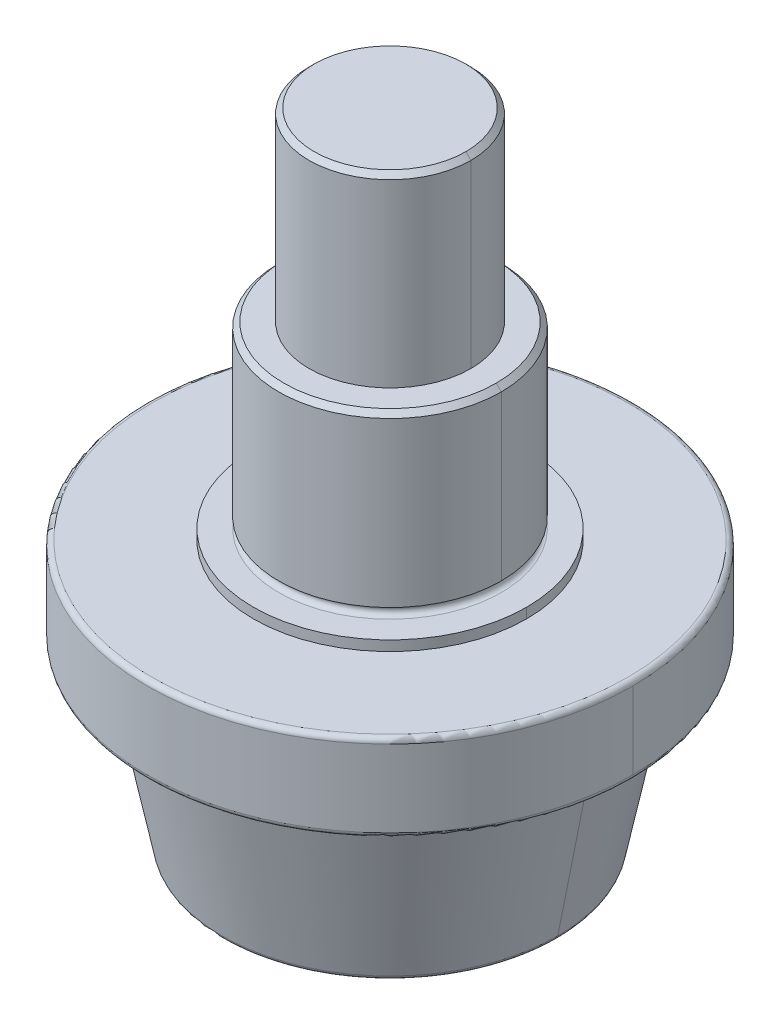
ISO-10303-21;
HEADER;
FILE_DESCRIPTION(('STEP AP214'),'2;1');
FILE_NAME('part.step','',(''),(''),'','','');
FILE_SCHEMA(('AUTOMOTIVE_DESIGN { 1 0 10303 214 1 1 1 1 }'));
ENDSEC;
DATA;
#1=APPLICATION_CONTEXT('core data for automotive mechanical design processes');
#2=APPLICATION_PROTOCOL_DEFINITION('international standard','automotive_design',2000,#1);
#3=PRODUCT_CONTEXT('',#1,'mechanical');
#4=PRODUCT('Part','Part','',(#3));
#5=PRODUCT_RELATED_PRODUCT_CATEGORY('part','',(#4));
#6=PRODUCT_DEFINITION_FORMATION('','',#4);
#7=PRODUCT_DEFINITION_CONTEXT('part definition',#1,'design');
#8=PRODUCT_DEFINITION('design','',#6,#7);
#9=PRODUCT_DEFINITION_SHAPE('','',#8);
#10=(LENGTH_UNIT() NAMED_UNIT(*) SI_UNIT(.MILLI.,.METRE.));
#11=(NAMED_UNIT(*) PLANE_ANGLE_UNIT() SI_UNIT($,.RADIAN.));
#12=(NAMED_UNIT(*) SI_UNIT($,.STERADIAN.) SOLID_ANGLE_UNIT());
#13=UNCERTAINTY_MEASURE_WITH_UNIT(LENGTH_MEASURE(1.E-05),#10,'distance_accuracy_value','');
#14=(GEOMETRIC_REPRESENTATION_CONTEXT(3) GLOBAL_UNCERTAINTY_ASSIGNED_CONTEXT((#13)) GLOBAL_UNIT_ASSIGNED_CONTEXT((#10,
#11,#12)) REPRESENTATION_CONTEXT('',''));
#15=CARTESIAN_POINT('',(0.,0.,0.));
#16=DIRECTION('',(0.,0.,1.));
#17=DIRECTION('',(1.,0.,0.));
#18=AXIS2_PLACEMENT_3D('',#15,#16,#17);
#19=CARTESIAN_POINT('',(-5.95312499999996,50.00625,0.));
#20=DIRECTION('',(0.,1.,0.));
#21=DIRECTION('',(0.,0.,1.));
#22=AXIS2_PLACEMENT_3D('',#19,#20,#21);
#23=PLANE('',#22);
#24=CARTESIAN_POINT('',(0.,50.00625,0.));
#25=DIRECTION('',(0.,-1.,0.));
#26=DIRECTION('',(0.,0.,-1.));
#27=AXIS2_PLACEMENT_3D('',#24,#25,#26);
#28=CIRCLE('',#27,11.90625);
#29=CARTESIAN_POINT('',(11.90625,50.00625,0.));
#30=VERTEX_POINT('',#29);
#31=CARTESIAN_POINT('',(-11.90625,50.00625,0.));
#32=VERTEX_POINT('',#31);
#33=EDGE_CURVE('E19',#30,#32,#28,.T.);
#34=ORIENTED_EDGE('',*,*,#33,.F.);
#35=CARTESIAN_POINT('',(0.,50.00625,0.));
#36=DIRECTION('',(0.,-1.,0.));
#37=DIRECTION('',(0.,0.,-1.));
#38=AXIS2_PLACEMENT_3D('',#35,#36,#37);
#39=CIRCLE('',#38,11.90625);
#40=EDGE_CURVE('E90',#32,#30,#39,.T.);
#41=ORIENTED_EDGE('',*,*,#40,.F.);
#42=EDGE_LOOP('',(#34,#41));
#43=FACE_BOUND('',#42,.T.);
#44=ADVANCED_FACE('F16',(#43),#23,.T.);
#45=CARTESIAN_POINT('',(-12.7718817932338,-50.00625,0.));
#46=DIRECTION('',(0.,-1.,0.));
#47=DIRECTION('',(1.,0.,0.));
#48=AXIS2_PLACEMENT_3D('',#45,#46,#47);
#49=PLANE('',#48);
#50=CARTESIAN_POINT('',(0.,-50.00625,0.));
#51=DIRECTION('',(0.,1.,0.));
#52=DIRECTION('',(-1.,0.,0.));
#53=AXIS2_PLACEMENT_3D('',#50,#51,#52);
#54=CIRCLE('',#53,25.5437635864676);
#55=CARTESIAN_POINT('',(-25.5437635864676,-50.00625,0.));
#56=VERTEX_POINT('',#55);
#57=EDGE_CURVE('E32',#56,#56,#54,.T.);
#58=ORIENTED_EDGE('',*,*,#57,.F.);
#59=EDGE_LOOP('',(#58));
#60=FACE_BOUND('',#59,.T.);
#61=ADVANCED_FACE('F108',(#60),#49,.T.);
#62=CARTESIAN_POINT('',(0.,49.2125,0.));
#63=DIRECTION('',(0.,-1.,0.));
#64=DIRECTION('',(0.,0.,-1.));
#65=AXIS2_PLACEMENT_3D('',#62,#63,#64);
#66=CONICAL_SURFACE('',#65,12.7,0.78539816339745);
#67=DIRECTION('',(-0.707106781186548,0.707106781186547,0.));
#68=VECTOR('',#67,1.);
#69=CARTESIAN_POINT('',(12.303125,49.609375,0.));
#70=LINE('',#69,#68);
#71=CARTESIAN_POINT('',(12.7,49.2125,0.));
#72=VERTEX_POINT('',#71);
#73=EDGE_CURVE('E88',#30,#72,#70,.F.);
#74=ORIENTED_EDGE('',*,*,#73,.F.);
#75=ORIENTED_EDGE('',*,*,#33,.T.);
#76=DIRECTION('',(0.707106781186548,0.707106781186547,0.));
#77=VECTOR('',#76,1.);
#78=CARTESIAN_POINT('',(-12.303125,49.609375,0.));
#79=LINE('',#78,#77);
#80=CARTESIAN_POINT('',(-12.7,49.2125,0.));
#81=VERTEX_POINT('',#80);
#82=EDGE_CURVE('E85',#81,#32,#79,.T.);
#83=ORIENTED_EDGE('',*,*,#82,.F.);
#84=CARTESIAN_POINT('',(0.,49.2125,0.));
#85=DIRECTION('',(0.,1.,0.));
#86=DIRECTION('',(-1.,0.,0.));
#87=AXIS2_PLACEMENT_3D('',#84,#85,#86);
#88=CIRCLE('',#87,12.7);
#89=EDGE_CURVE('E134',#72,#81,#88,.F.);
#90=ORIENTED_EDGE('',*,*,#89,.F.);
#91=EDGE_LOOP('',(#74,#75,#83,#90));
#92=FACE_BOUND('',#91,.T.);
#93=ADVANCED_FACE('F83',(#92),#66,.T.);
#94=CARTESIAN_POINT('',(0.,49.2125,0.));
#95=DIRECTION('',(0.,-1.,0.));
#96=DIRECTION('',(0.,0.,-1.));
#97=AXIS2_PLACEMENT_3D('',#94,#95,#96);
#98=CONICAL_SURFACE('',#97,12.7,0.78539816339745);
#99=ORIENTED_EDGE('',*,*,#73,.T.);
#100=CARTESIAN_POINT('',(0.,49.2125,0.));
#101=DIRECTION('',(0.,1.,0.));
#102=DIRECTION('',(-1.,0.,0.));
#103=AXIS2_PLACEMENT_3D('',#100,#101,#102);
#104=CIRCLE('',#103,12.7);
#105=EDGE_CURVE('E95',#81,#72,#104,.F.);
#106=ORIENTED_EDGE('',*,*,#105,.F.);
#107=ORIENTED_EDGE('',*,*,#82,.T.);
#108=ORIENTED_EDGE('',*,*,#40,.T.);
#109=EDGE_LOOP('',(#99,#106,#107,#108));
#110=FACE_BOUND('',#109,.T.);
#111=ADVANCED_FACE('F93',(#110),#98,.T.);
#112=CARTESIAN_POINT('',(0.,-49.2125,0.));
#113=DIRECTION('',(0.,-1.,0.));
#114=DIRECTION('',(0.,0.,-1.));
#115=AXIS2_PLACEMENT_3D('',#112,#113,#114);
#116=TOROIDAL_SURFACE('',#115,25.5437635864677,0.793750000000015);
#117=CARTESIAN_POINT('',(0.,-49.3690271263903,0.));
#118=DIRECTION('',(0.,1.,0.));
#119=DIRECTION('',(-1.,0.,0.));
#120=AXIS2_PLACEMENT_3D('',#117,#118,#119);
#121=CIRCLE('',#120,26.3219270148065);
#122=CARTESIAN_POINT('',(-26.3219270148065,-49.3690271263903,0.));
#123=VERTEX_POINT('',#122);
#124=CARTESIAN_POINT('',(26.3219270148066,-49.3690271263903,0.));
#125=VERTEX_POINT('',#124);
#126=EDGE_CURVE('E151',#123,#125,#121,.T.);
#127=ORIENTED_EDGE('',*,*,#126,.F.);
#128=CARTESIAN_POINT('',(0.,-49.3690271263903,0.));
#129=DIRECTION('',(0.,1.,0.));
#130=DIRECTION('',(-1.,0.,0.));
#131=AXIS2_PLACEMENT_3D('',#128,#129,#130);
#132=CIRCLE('',#131,26.3219270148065);
#133=EDGE_CURVE('E166',#125,#123,#132,.T.);
#134=ORIENTED_EDGE('',*,*,#133,.F.);
#135=EDGE_LOOP('',(#127,#134));
#136=FACE_BOUND('',#135,.T.);
#137=ORIENTED_EDGE('',*,*,#57,.T.);
#138=EDGE_LOOP('',(#137));
#139=FACE_BOUND('',#138,.T.);
#140=ADVANCED_FACE('F121',(#136,#139),#116,.T.);
#141=CARTESIAN_POINT('',(0.,35.0678750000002,0.));
#142=DIRECTION('',(0.,1.,0.));
#143=DIRECTION('',(-1.,0.,0.));
#144=AXIS2_PLACEMENT_3D('',#141,#142,#143);
#145=CYLINDRICAL_SURFACE('',#144,12.7);
#146=DIRECTION('',(0.,1.,0.));
#147=VECTOR('',#146,1.);
#148=CARTESIAN_POINT('',(12.7,35.0678750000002,0.));
#149=LINE('',#148,#147);
#150=CARTESIAN_POINT('',(12.7,20.9232499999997,0.));
#151=VERTEX_POINT('',#150);
#152=EDGE_CURVE('E140',#72,#151,#149,.F.);
#153=ORIENTED_EDGE('',*,*,#152,.F.);
#154=ORIENTED_EDGE('',*,*,#89,.T.);
#155=DIRECTION('',(0.,1.,0.));
#156=VECTOR('',#155,1.);
#157=CARTESIAN_POINT('',(-12.7,35.0678750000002,0.));
#158=LINE('',#157,#156);
#159=CARTESIAN_POINT('',(-12.7,20.9232499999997,0.));
#160=VERTEX_POINT('',#159);
#161=EDGE_CURVE('E136',#160,#81,#158,.T.);
#162=ORIENTED_EDGE('',*,*,#161,.F.);
#163=CARTESIAN_POINT('',(0.,20.9232499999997,0.));
#164=DIRECTION('',(0.,1.,0.));
#165=DIRECTION('',(-1.,0.,0.));
#166=AXIS2_PLACEMENT_3D('',#163,#164,#165);
#167=CIRCLE('',#166,12.7);
#168=EDGE_CURVE('E147',#151,#160,#167,.F.);
#169=ORIENTED_EDGE('',*,*,#168,.F.);
#170=EDGE_LOOP('',(#153,#154,#162,#169));
#171=FACE_BOUND('',#170,.T.);
#172=ADVANCED_FACE('F126',(#171),#145,.T.);
#173=CARTESIAN_POINT('',(0.,35.0678750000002,0.));
#174=DIRECTION('',(0.,1.,0.));
#175=DIRECTION('',(-1.,0.,0.));
#176=AXIS2_PLACEMENT_3D('',#173,#174,#175);
#177=CYLINDRICAL_SURFACE('',#176,12.7);
#178=ORIENTED_EDGE('',*,*,#152,.T.);
#179=CARTESIAN_POINT('',(0.,20.9232499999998,0.));
#180=DIRECTION('',(0.,1.,0.));
#181=DIRECTION('',(-1.,0.,0.));
#182=AXIS2_PLACEMENT_3D('',#179,#180,#181);
#183=CIRCLE('',#182,12.7);
#184=EDGE_CURVE('E154',#160,#151,#183,.F.);
#185=ORIENTED_EDGE('',*,*,#184,.F.);
#186=ORIENTED_EDGE('',*,*,#161,.T.);
#187=ORIENTED_EDGE('',*,*,#105,.T.);
#188=EDGE_LOOP('',(#178,#185,#186,#187));
#189=FACE_BOUND('',#188,.T.);
#190=ADVANCED_FACE('F153',(#189),#177,.T.);
#191=CARTESIAN_POINT('',(0.,-23.0209728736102,0.));
#192=DIRECTION('',(0.,1.,0.));
#193=DIRECTION('',(-1.,0.,0.));
#194=AXIS2_PLACEMENT_3D('',#191,#192,#193);
#195=CONICAL_SURFACE('',#194,31.6218229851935,0.198500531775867);
#196=DIRECTION('',(-0.197199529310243,-0.980363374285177,0.));
#197=VECTOR('',#196,1.);
#198=CARTESIAN_POINT('',(28.971875,-36.1950000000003,0.));
#199=LINE('',#198,#197);
#200=CARTESIAN_POINT('',(31.6218229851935,-23.0209728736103,0.));
#201=VERTEX_POINT('',#200);
#202=EDGE_CURVE('E163',#201,#125,#199,.T.);
#203=ORIENTED_EDGE('',*,*,#202,.F.);
#204=CARTESIAN_POINT('',(0.,-23.0209728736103,0.));
#205=DIRECTION('',(0.,-1.,0.));
#206=DIRECTION('',(0.,0.,-1.));
#207=AXIS2_PLACEMENT_3D('',#204,#205,#206);
#208=CIRCLE('',#207,31.6218229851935);
#209=CARTESIAN_POINT('',(-31.6218229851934,-23.0209728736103,0.));
#210=VERTEX_POINT('',#209);
#211=EDGE_CURVE('E226',#210,#201,#208,.F.);
#212=ORIENTED_EDGE('',*,*,#211,.F.);
#213=DIRECTION('',(0.197199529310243,-0.980363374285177,0.));
#214=VECTOR('',#213,1.);
#215=CARTESIAN_POINT('',(-28.971875,-36.1950000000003,0.));
#216=LINE('',#215,#214);
#217=EDGE_CURVE('E160',#123,#210,#216,.F.);
#218=ORIENTED_EDGE('',*,*,#217,.F.);
#219=ORIENTED_EDGE('',*,*,#126,.T.);
#220=EDGE_LOOP('',(#203,#212,#218,#219));
#221=FACE_BOUND('',#220,.T.);
#222=ADVANCED_FACE('F415',(#221),#195,.T.);
#223=CARTESIAN_POINT('',(0.,-23.0209728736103,0.));
#224=DIRECTION('',(0.,1.,0.));
#225=DIRECTION('',(-1.,0.,0.));
#226=AXIS2_PLACEMENT_3D('',#223,#224,#225);
#227=CONICAL_SURFACE('',#226,31.6218229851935,0.198500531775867);
#228=ORIENTED_EDGE('',*,*,#202,.T.);
#229=ORIENTED_EDGE('',*,*,#133,.T.);
#230=ORIENTED_EDGE('',*,*,#217,.T.);
#231=CARTESIAN_POINT('',(0.,-23.0209728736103,0.));
#232=DIRECTION('',(0.,-1.,0.));
#233=DIRECTION('',(0.,0.,-1.));
#234=AXIS2_PLACEMENT_3D('',#231,#232,#233);
#235=CIRCLE('',#234,31.6218229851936);
#236=EDGE_CURVE('E224',#201,#210,#235,.F.);
#237=ORIENTED_EDGE('',*,*,#236,.F.);
#238=EDGE_LOOP('',(#228,#229,#230,#237));
#239=FACE_BOUND('',#238,.T.);
#240=ADVANCED_FACE('F418',(#239),#227,.T.);
#241=CARTESIAN_POINT('',(-14.684375,20.9232499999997,0.));
#242=DIRECTION('',(0.,1.,0.));
#243=DIRECTION('',(0.,0.,1.));
#244=AXIS2_PLACEMENT_3D('',#241,#242,#243);
#245=PLANE('',#244);
#246=ORIENTED_EDGE('',*,*,#168,.T.);
#247=ORIENTED_EDGE('',*,*,#184,.T.);
#248=EDGE_LOOP('',(#246,#247));
#249=FACE_BOUND('',#248,.T.);
#250=CARTESIAN_POINT('',(0.,20.9232499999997,0.));
#251=DIRECTION('',(0.,-1.,0.));
#252=DIRECTION('',(0.,0.,-1.));
#253=AXIS2_PLACEMENT_3D('',#250,#251,#252);
#254=CIRCLE('',#253,16.6687500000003);
#255=CARTESIAN_POINT('',(16.6687500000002,20.9232499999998,0.));
#256=VERTEX_POINT('',#255);
#257=CARTESIAN_POINT('',(-16.6687500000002,20.9232499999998,0.));
#258=VERTEX_POINT('',#257);
#259=EDGE_CURVE('E195',#256,#258,#254,.T.);
#260=ORIENTED_EDGE('',*,*,#259,.F.);
#261=CARTESIAN_POINT('',(0.,20.9232499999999,0.));
#262=DIRECTION('',(0.,-1.,0.));
#263=DIRECTION('',(1.,0.,0.));
#264=AXIS2_PLACEMENT_3D('',#261,#262,#263);
#265=CIRCLE('',#264,16.6687500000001);
#266=EDGE_CURVE('E189',#258,#256,#265,.T.);
#267=ORIENTED_EDGE('',*,*,#266,.F.);
#268=EDGE_LOOP('',(#260,#267));
#269=FACE_BOUND('',#268,.T.);
#270=ADVANCED_FACE('F213',(#249,#269),#245,.T.);
#271=CARTESIAN_POINT('',(0.,-23.1775000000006,0.));
#272=DIRECTION('',(0.,-1.,0.));
#273=DIRECTION('',(0.,0.,-1.));
#274=AXIS2_PLACEMENT_3D('',#271,#272,#273);
#275=TOROIDAL_SURFACE('',#274,32.3999864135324,0.793750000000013);
#276=CARTESIAN_POINT('',(0.,-22.3837500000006,0.));
#277=DIRECTION('',(0.,-1.,0.));
#278=DIRECTION('',(-1.,0.,0.));
#279=AXIS2_PLACEMENT_3D('',#276,#277,#278);
#280=CIRCLE('',#279,32.3999864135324);
#281=CARTESIAN_POINT('',(-32.3999864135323,-22.3837500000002,0.));
#282=VERTEX_POINT('',#281);
#283=EDGE_CURVE('E185',#282,#282,#280,.F.);
#284=ORIENTED_EDGE('',*,*,#283,.F.);
#285=EDGE_LOOP('',(#284));
#286=FACE_BOUND('',#285,.T.);
#287=ORIENTED_EDGE('',*,*,#211,.T.);
#288=ORIENTED_EDGE('',*,*,#236,.T.);
#289=EDGE_LOOP('',(#287,#288));
#290=FACE_BOUND('',#289,.T.);
#291=ADVANCED_FACE('F201',(#286,#290),#275,.F.);
#292=CARTESIAN_POINT('',(0.,20.1294999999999,0.));
#293=DIRECTION('',(0.,-1.,0.));
#294=DIRECTION('',(0.,0.,-1.));
#295=AXIS2_PLACEMENT_3D('',#292,#293,#294);
#296=CONICAL_SURFACE('',#295,17.4625000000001,0.78539816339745);
#297=DIRECTION('',(-0.707106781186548,0.707106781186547,0.));
#298=VECTOR('',#297,1.);
#299=CARTESIAN_POINT('',(17.0656250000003,20.5263749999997,0.));
#300=LINE('',#299,#298);
#301=CARTESIAN_POINT('',(17.4625000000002,20.1294999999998,0.));
#302=VERTEX_POINT('',#301);
#303=EDGE_CURVE('E186',#256,#302,#300,.F.);
#304=ORIENTED_EDGE('',*,*,#303,.F.);
#305=ORIENTED_EDGE('',*,*,#259,.T.);
#306=DIRECTION('',(0.707106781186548,0.707106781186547,0.));
#307=VECTOR('',#306,1.);
#308=CARTESIAN_POINT('',(-17.0656250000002,20.5263749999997,0.));
#309=LINE('',#308,#307);
#310=CARTESIAN_POINT('',(-17.4625000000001,20.1294999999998,0.));
#311=VERTEX_POINT('',#310);
#312=EDGE_CURVE('E192',#311,#258,#309,.T.);
#313=ORIENTED_EDGE('',*,*,#312,.F.);
#314=CARTESIAN_POINT('',(0.,20.1294999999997,0.));
#315=DIRECTION('',(0.,1.,0.));
#316=DIRECTION('',(-1.,0.,0.));
#317=AXIS2_PLACEMENT_3D('',#314,#315,#316);
#318=CIRCLE('',#317,17.4625000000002);
#319=EDGE_CURVE('E175',#302,#311,#318,.F.);
#320=ORIENTED_EDGE('',*,*,#319,.F.);
#321=EDGE_LOOP('',(#304,#305,#313,#320));
#322=FACE_BOUND('',#321,.T.);
#323=ADVANCED_FACE('F212',(#322),#296,.T.);
#324=CARTESIAN_POINT('',(0.,20.1294999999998,0.));
#325=DIRECTION('',(0.,-1.,0.));
#326=DIRECTION('',(1.,0.,0.));
#327=AXIS2_PLACEMENT_3D('',#324,#325,#326);
#328=CONICAL_SURFACE('',#327,17.4625000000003,0.78539816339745);
#329=ORIENTED_EDGE('',*,*,#303,.T.);
#330=CARTESIAN_POINT('',(0.,20.1294999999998,0.));
#331=DIRECTION('',(0.,1.,0.));
#332=DIRECTION('',(-1.,0.,0.));
#333=AXIS2_PLACEMENT_3D('',#330,#331,#332);
#334=CIRCLE('',#333,17.4625000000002);
#335=EDGE_CURVE('E174',#311,#302,#334,.F.);
#336=ORIENTED_EDGE('',*,*,#335,.F.);
#337=ORIENTED_EDGE('',*,*,#312,.T.);
#338=ORIENTED_EDGE('',*,*,#266,.T.);
#339=EDGE_LOOP('',(#329,#336,#337,#338));
#340=FACE_BOUND('',#339,.T.);
#341=ADVANCED_FACE('F370',(#340),#328,.T.);
#342=CARTESIAN_POINT('',(-34.8531182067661,-22.3837499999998,0.));
#343=DIRECTION('',(0.,-1.,0.));
#344=DIRECTION('',(1.,0.,0.));
#345=AXIS2_PLACEMENT_3D('',#342,#343,#344);
#346=PLANE('',#345);
#347=CARTESIAN_POINT('',(0.,-22.3837499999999,0.));
#348=DIRECTION('',(0.,1.,0.));
#349=DIRECTION('',(-1.,0.,0.));
#350=AXIS2_PLACEMENT_3D('',#347,#348,#349);
#351=CIRCLE('',#350,37.30625);
#352=CARTESIAN_POINT('',(-37.3062499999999,-22.3837499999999,0.));
#353=VERTEX_POINT('',#352);
#354=EDGE_CURVE('E350',#353,#353,#351,.T.);
#355=ORIENTED_EDGE('',*,*,#354,.F.);
#356=EDGE_LOOP('',(#355));
#357=FACE_BOUND('',#356,.T.);
#358=ORIENTED_EDGE('',*,*,#283,.T.);
#359=EDGE_LOOP('',(#358));
#360=FACE_BOUND('',#359,.T.);
#361=ADVANCED_FACE('F360',(#357,#360),#346,.T.);
#362=CARTESIAN_POINT('',(0.,7.28662499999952,0.));
#363=DIRECTION('',(0.,1.,0.));
#364=DIRECTION('',(-1.,0.,0.));
#365=AXIS2_PLACEMENT_3D('',#362,#363,#364);
#366=CYLINDRICAL_SURFACE('',#365,17.4625000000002);
#367=DIRECTION('',(0.,1.,0.));
#368=VECTOR('',#367,1.);
#369=CARTESIAN_POINT('',(17.4625000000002,7.28662499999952,0.));
#370=LINE('',#369,#368);
#371=CARTESIAN_POINT('',(17.4625000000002,-5.55624999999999,0.));
#372=VERTEX_POINT('',#371);
#373=EDGE_CURVE('E180',#302,#372,#370,.F.);
#374=ORIENTED_EDGE('',*,*,#373,.F.);
#375=ORIENTED_EDGE('',*,*,#319,.T.);
#376=DIRECTION('',(0.,1.,0.));
#377=VECTOR('',#376,1.);
#378=CARTESIAN_POINT('',(-17.4625000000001,7.28662499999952,0.));
#379=LINE('',#378,#377);
#380=CARTESIAN_POINT('',(-17.4625000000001,-5.55624999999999,0.));
#381=VERTEX_POINT('',#380);
#382=EDGE_CURVE('E171',#381,#311,#379,.T.);
#383=ORIENTED_EDGE('',*,*,#382,.F.);
#384=CARTESIAN_POINT('',(0.,-5.55624999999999,0.));
#385=DIRECTION('',(0.,-1.,0.));
#386=DIRECTION('',(0.,0.,-1.));
#387=AXIS2_PLACEMENT_3D('',#384,#385,#386);
#388=CIRCLE('',#387,17.4625000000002);
#389=EDGE_CURVE('E383',#372,#381,#388,.T.);
#390=ORIENTED_EDGE('',*,*,#389,.F.);
#391=EDGE_LOOP('',(#374,#375,#383,#390));
#392=FACE_BOUND('',#391,.T.);
#393=ADVANCED_FACE('F369',(#392),#366,.T.);
#394=CARTESIAN_POINT('',(0.,7.28662499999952,0.));
#395=DIRECTION('',(0.,1.,0.));
#396=DIRECTION('',(-1.,0.,0.));
#397=AXIS2_PLACEMENT_3D('',#394,#395,#396);
#398=CYLINDRICAL_SURFACE('',#397,17.4625000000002);
#399=ORIENTED_EDGE('',*,*,#373,.T.);
#400=CARTESIAN_POINT('',(0.,-5.55624999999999,0.));
#401=DIRECTION('',(0.,-1.,0.));
#402=DIRECTION('',(0.,0.,-1.));
#403=AXIS2_PLACEMENT_3D('',#400,#401,#402);
#404=CIRCLE('',#403,17.4625);
#405=EDGE_CURVE('E322',#381,#372,#404,.T.);
#406=ORIENTED_EDGE('',*,*,#405,.F.);
#407=ORIENTED_EDGE('',*,*,#382,.T.);
#408=ORIENTED_EDGE('',*,*,#335,.T.);
#409=EDGE_LOOP('',(#399,#406,#407,#408));
#410=FACE_BOUND('',#409,.T.);
#411=ADVANCED_FACE('F394',(#410),#398,.T.);
#412=CARTESIAN_POINT('',(0.,-21.5899999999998,0.));
#413=DIRECTION('',(0.,-1.,0.));
#414=DIRECTION('',(0.,0.,-1.));
#415=AXIS2_PLACEMENT_3D('',#412,#413,#414);
#416=TOROIDAL_SURFACE('',#415,37.30625,0.793750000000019);
#417=CARTESIAN_POINT('',(0.,-21.5899999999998,0.));
#418=DIRECTION('',(0.,1.,0.));
#419=DIRECTION('',(-1.,0.,0.));
#420=AXIS2_PLACEMENT_3D('',#417,#418,#419);
#421=CIRCLE('',#420,38.1000000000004);
#422=CARTESIAN_POINT('',(-38.1000000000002,-21.5899999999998,0.));
#423=VERTEX_POINT('',#422);
#424=CARTESIAN_POINT('',(38.1000000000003,-21.5899999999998,0.));
#425=VERTEX_POINT('',#424);
#426=EDGE_CURVE('E319',#423,#425,#421,.T.);
#427=ORIENTED_EDGE('',*,*,#426,.F.);
#428=CARTESIAN_POINT('',(0.,-21.5899999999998,0.));
#429=DIRECTION('',(0.,1.,0.));
#430=DIRECTION('',(-1.,0.,0.));
#431=AXIS2_PLACEMENT_3D('',#428,#429,#430);
#432=CIRCLE('',#431,38.1000000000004);
#433=EDGE_CURVE('E305',#425,#423,#432,.T.);
#434=ORIENTED_EDGE('',*,*,#433,.F.);
#435=EDGE_LOOP('',(#427,#434));
#436=FACE_BOUND('',#435,.T.);
#437=ORIENTED_EDGE('',*,*,#354,.T.);
#438=EDGE_LOOP('',(#437));
#439=FACE_BOUND('',#438,.T.);
#440=ADVANCED_FACE('F332',(#436,#439),#416,.T.);
#441=CARTESIAN_POINT('',(0.,-6.34999999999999,0.));
#442=DIRECTION('',(0.,-1.,0.));
#443=DIRECTION('',(0.,0.,-1.));
#444=AXIS2_PLACEMENT_3D('',#441,#442,#443);
#445=TOROIDAL_SURFACE('',#444,17.4625000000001,0.79375);
#446=ORIENTED_EDGE('',*,*,#389,.T.);
#447=ORIENTED_EDGE('',*,*,#405,.T.);
#448=EDGE_LOOP('',(#446,#447));
#449=FACE_BOUND('',#448,.T.);
#450=CARTESIAN_POINT('',(0.,-7.14374999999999,0.));
#451=DIRECTION('',(0.,1.,0.));
#452=DIRECTION('',(-1.,0.,0.));
#453=AXIS2_PLACEMENT_3D('',#450,#451,#452);
#454=CIRCLE('',#453,17.4625);
#455=CARTESIAN_POINT('',(-17.4625,-7.14374999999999,0.));
#456=VERTEX_POINT('',#455);
#457=EDGE_CURVE('E301',#456,#456,#454,.F.);
#458=ORIENTED_EDGE('',*,*,#457,.F.);
#459=EDGE_LOOP('',(#458));
#460=FACE_BOUND('',#459,.T.);
#461=ADVANCED_FACE('F327',(#449,#460),#445,.F.);
#462=CARTESIAN_POINT('',(0.,-15.5575000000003,0.));
#463=DIRECTION('',(0.,1.,0.));
#464=DIRECTION('',(-1.,0.,0.));
#465=AXIS2_PLACEMENT_3D('',#462,#463,#464);
#466=CYLINDRICAL_SURFACE('',#465,38.1000000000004);
#467=DIRECTION('',(0.,1.,0.));
#468=VECTOR('',#467,1.);
#469=CARTESIAN_POINT('',(38.1000000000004,-15.5575000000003,0.));
#470=LINE('',#469,#468);
#471=CARTESIAN_POINT('',(38.1000000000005,-9.52500000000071,0.));
#472=VERTEX_POINT('',#471);
#473=EDGE_CURVE('E313',#472,#425,#470,.F.);
#474=ORIENTED_EDGE('',*,*,#473,.F.);
#475=CARTESIAN_POINT('',(0.,-9.52500000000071,0.));
#476=DIRECTION('',(0.,-1.,0.));
#477=DIRECTION('',(0.,0.,-1.));
#478=AXIS2_PLACEMENT_3D('',#475,#476,#477);
#479=CIRCLE('',#478,38.1000000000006);
#480=CARTESIAN_POINT('',(-38.1000000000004,-9.52500000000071,0.));
#481=VERTEX_POINT('',#480);
#482=EDGE_CURVE('E460',#481,#472,#479,.F.);
#483=ORIENTED_EDGE('',*,*,#482,.F.);
#484=DIRECTION('',(0.,1.,0.));
#485=VECTOR('',#484,1.);
#486=CARTESIAN_POINT('',(-38.1000000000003,-15.5575000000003,0.));
#487=LINE('',#486,#485);
#488=EDGE_CURVE('E316',#423,#481,#487,.T.);
#489=ORIENTED_EDGE('',*,*,#488,.F.);
#490=ORIENTED_EDGE('',*,*,#426,.T.);
#491=EDGE_LOOP('',(#474,#483,#489,#490));
#492=FACE_BOUND('',#491,.T.);
#493=ADVANCED_FACE('F331',(#492),#466,.T.);
#494=CARTESIAN_POINT('',(0.,-15.5575000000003,0.));
#495=DIRECTION('',(0.,1.,0.));
#496=DIRECTION('',(-1.,0.,0.));
#497=AXIS2_PLACEMENT_3D('',#494,#495,#496);
#498=CYLINDRICAL_SURFACE('',#497,38.1000000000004);
#499=ORIENTED_EDGE('',*,*,#473,.T.);
#500=ORIENTED_EDGE('',*,*,#433,.T.);
#501=ORIENTED_EDGE('',*,*,#488,.T.);
#502=CARTESIAN_POINT('',(0.,-9.52500000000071,0.));
#503=DIRECTION('',(0.,-1.,0.));
#504=DIRECTION('',(0.,0.,-1.));
#505=AXIS2_PLACEMENT_3D('',#502,#503,#504);
#506=CIRCLE('',#505,38.1000000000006);
#507=EDGE_CURVE('E240',#472,#481,#506,.F.);
#508=ORIENTED_EDGE('',*,*,#507,.F.);
#509=EDGE_LOOP('',(#499,#500,#501,#508));
#510=FACE_BOUND('',#509,.T.);
#511=ADVANCED_FACE('F442',(#510),#498,.T.);
#512=CARTESIAN_POINT('',(-19.446875,-7.14374999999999,0.));
#513=DIRECTION('',(0.,1.,0.));
#514=DIRECTION('',(0.,0.,1.));
#515=AXIS2_PLACEMENT_3D('',#512,#513,#514);
#516=PLANE('',#515);
#517=ORIENTED_EDGE('',*,*,#457,.T.);
#518=EDGE_LOOP('',(#517));
#519=FACE_BOUND('',#518,.T.);
#520=CARTESIAN_POINT('',(0.,-7.14374999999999,0.));
#521=DIRECTION('',(0.,1.,0.));
#522=DIRECTION('',(-1.,0.,0.));
#523=AXIS2_PLACEMENT_3D('',#520,#521,#522);
#524=CIRCLE('',#523,21.43125);
#525=CARTESIAN_POINT('',(21.43125,-7.14374999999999,0.));
#526=VERTEX_POINT('',#525);
#527=CARTESIAN_POINT('',(-21.43125,-7.14374999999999,0.));
#528=VERTEX_POINT('',#527);
#529=EDGE_CURVE('E237',#526,#528,#524,.F.);
#530=ORIENTED_EDGE('',*,*,#529,.F.);
#531=CARTESIAN_POINT('',(0.,-7.14374999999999,0.));
#532=DIRECTION('',(0.,1.,0.));
#533=DIRECTION('',(-1.,0.,0.));
#534=AXIS2_PLACEMENT_3D('',#531,#532,#533);
#535=CIRCLE('',#534,21.43125);
#536=EDGE_CURVE('E241',#528,#526,#535,.F.);
#537=ORIENTED_EDGE('',*,*,#536,.F.);
#538=EDGE_LOOP('',(#530,#537));
#539=FACE_BOUND('',#538,.T.);
#540=ADVANCED_FACE('F281',(#519,#539),#516,.T.);
#541=CARTESIAN_POINT('',(0.,-9.52500000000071,0.));
#542=DIRECTION('',(0.,-1.,0.));
#543=DIRECTION('',(0.,0.,-1.));
#544=AXIS2_PLACEMENT_3D('',#541,#542,#543);
#545=TOROIDAL_SURFACE('',#544,37.3062500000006,0.793750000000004);
#546=CARTESIAN_POINT('',(0.,-8.73125000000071,0.));
#547=DIRECTION('',(0.,-1.,0.));
#548=DIRECTION('',(-1.,0.,0.));
#549=AXIS2_PLACEMENT_3D('',#546,#547,#548);
#550=CIRCLE('',#549,37.3062500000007);
#551=CARTESIAN_POINT('',(-37.3062500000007,-8.73125000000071,0.));
#552=VERTEX_POINT('',#551);
#553=EDGE_CURVE('E246',#552,#552,#550,.F.);
#554=ORIENTED_EDGE('',*,*,#553,.F.);
#555=EDGE_LOOP('',(#554));
#556=FACE_BOUND('',#555,.T.);
#557=ORIENTED_EDGE('',*,*,#482,.T.);
#558=ORIENTED_EDGE('',*,*,#507,.T.);
#559=EDGE_LOOP('',(#557,#558));
#560=FACE_BOUND('',#559,.T.);
#561=ADVANCED_FACE('F275',(#556,#560),#545,.T.);
#562=CARTESIAN_POINT('',(0.,-7.93749999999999,0.));
#563=DIRECTION('',(0.,1.,0.));
#564=DIRECTION('',(-1.,0.,0.));
#565=AXIS2_PLACEMENT_3D('',#562,#563,#564);
#566=CYLINDRICAL_SURFACE('',#565,21.43125);
#567=DIRECTION('',(0.,1.,0.));
#568=VECTOR('',#567,1.);
#569=CARTESIAN_POINT('',(21.43125,-7.93749999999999,0.));
#570=LINE('',#569,#568);
#571=CARTESIAN_POINT('',(21.43125,-8.73124999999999,0.));
#572=VERTEX_POINT('',#571);
#573=EDGE_CURVE('E244',#526,#572,#570,.F.);
#574=ORIENTED_EDGE('',*,*,#573,.F.);
#575=ORIENTED_EDGE('',*,*,#529,.T.);
#576=DIRECTION('',(0.,1.,0.));
#577=VECTOR('',#576,1.);
#578=CARTESIAN_POINT('',(-21.43125,-7.93749999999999,0.));
#579=LINE('',#578,#577);
#580=CARTESIAN_POINT('',(-21.43125,-8.73124999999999,0.));
#581=VERTEX_POINT('',#580);
#582=EDGE_CURVE('E239',#581,#528,#579,.T.);
#583=ORIENTED_EDGE('',*,*,#582,.F.);
#584=CARTESIAN_POINT('',(0.,-8.73124999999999,0.));
#585=DIRECTION('',(0.,1.,0.));
#586=DIRECTION('',(-1.,0.,0.));
#587=AXIS2_PLACEMENT_3D('',#584,#585,#586);
#588=CIRCLE('',#587,21.43125);
#589=EDGE_CURVE('E25',#572,#581,#588,.F.);
#590=ORIENTED_EDGE('',*,*,#589,.F.);
#591=EDGE_LOOP('',(#574,#575,#583,#590));
#592=FACE_BOUND('',#591,.T.);
#593=ADVANCED_FACE('F280',(#592),#566,.T.);
#594=CARTESIAN_POINT('',(0.,-7.93749999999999,0.));
#595=DIRECTION('',(0.,1.,0.));
#596=DIRECTION('',(-1.,0.,0.));
#597=AXIS2_PLACEMENT_3D('',#594,#595,#596);
#598=CYLINDRICAL_SURFACE('',#597,21.43125);
#599=ORIENTED_EDGE('',*,*,#573,.T.);
#600=CARTESIAN_POINT('',(0.,-8.73124999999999,0.));
#601=DIRECTION('',(0.,1.,0.));
#602=DIRECTION('',(-1.,0.,0.));
#603=AXIS2_PLACEMENT_3D('',#600,#601,#602);
#604=CIRCLE('',#603,21.43125);
#605=EDGE_CURVE('E11',#581,#572,#604,.F.);
#606=ORIENTED_EDGE('',*,*,#605,.F.);
#607=ORIENTED_EDGE('',*,*,#582,.T.);
#608=ORIENTED_EDGE('',*,*,#536,.T.);
#609=EDGE_LOOP('',(#599,#606,#607,#608));
#610=FACE_BOUND('',#609,.T.);
#611=ADVANCED_FACE('F428',(#610),#598,.T.);
#612=CARTESIAN_POINT('',(-29.36875,-8.73125000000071,0.));
#613=DIRECTION('',(0.,1.,0.));
#614=DIRECTION('',(0.,0.,1.));
#615=AXIS2_PLACEMENT_3D('',#612,#613,#614);
#616=PLANE('',#615);
#617=ORIENTED_EDGE('',*,*,#589,.T.);
#618=ORIENTED_EDGE('',*,*,#605,.T.);
#619=EDGE_LOOP('',(#617,#618));
#620=FACE_BOUND('',#619,.T.);
#621=ORIENTED_EDGE('',*,*,#553,.T.);
#622=EDGE_LOOP('',(#621));
#623=FACE_BOUND('',#622,.T.);
#624=ADVANCED_FACE('F426',(#620,#623),#616,.T.);
#625=CLOSED_SHELL('',(#44,#61,#93,#111,#140,#172,#190,#222,#240,#270,#291,#323,#341,#361,#393,
#411,#440,#461,#493,#511,#540,#561,#593,#611,#624));
#626=MANIFOLD_SOLID_BREP('B1',#625);
#627=ADVANCED_BREP_SHAPE_REPRESENTATION('',(#18,#626),#14);
#628=SHAPE_DEFINITION_REPRESENTATION(#9,#627);
ENDSEC;
END-ISO-10303-21;
